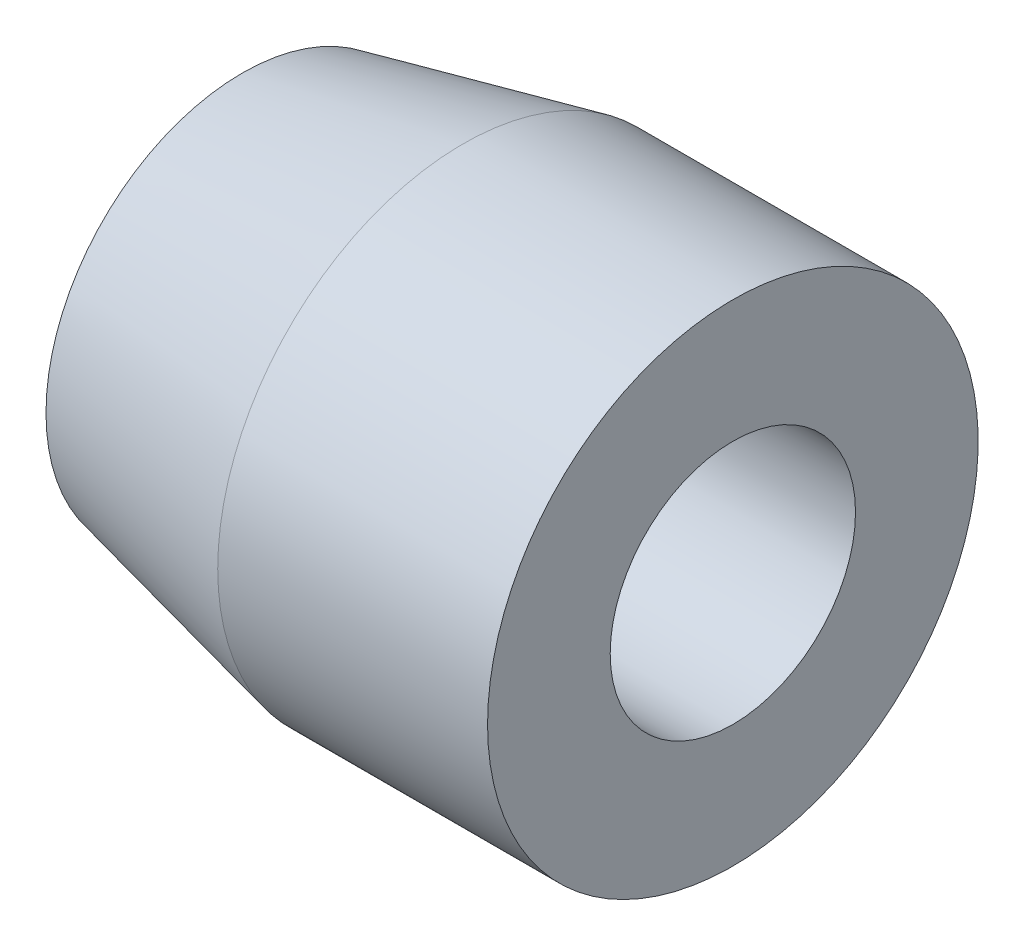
from build123d import *

# Parameters (mm, degrees)
ESQUISSE3_R             = 2.5
ENL_V_MAT_EXTRU_2_DEPTH = 7
ENL_V_MAT_EXTRU_4_DEPTH = 3


with BuildPart() as part:
    # Esquisse1 → Base-R_volution (revolve)
    with BuildSketch(Plane.XY, mode=Mode.PRIVATE) as base_r_volution_sk:
        Polygon((0, 0), (-5.5, 0), (-10, 1), (-10, 5), (0, 5), align=None)
    revolve(base_r_volution_sk.sketch.rotate(Axis((-40, 5, 0), (1, 0, 0)), 270), axis=Axis((-40, 5, 0), (1, 0, 0)))

    # Esquisse3 → Enl_v. mat.-Extru.2 (cut)
    with BuildSketch(Plane(origin=(0, 0, 0), x_dir=(0, 0, -1), z_dir=(1, 0, 0))):
        with Locations((0, 5)):
            Circle(ESQUISSE3_R)
    extrude(amount=-ENL_V_MAT_EXTRU_2_DEPTH, mode=Mode.SUBTRACT)

    # Esquisse4 → Enl_v. mat.-Extru.4 (cut)
    with BuildSketch(Plane.ZY.offset(10)):
        Polygon((-1.787522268, 7.941907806), (1.712477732, 7.941907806), (3.462477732, 4.910818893), (1.712477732, 1.879729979), (-1.787522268, 1.879729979), (-3.537522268, 4.910818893), align=None)
    extrude(amount=-ENL_V_MAT_EXTRU_4_DEPTH, mode=Mode.SUBTRACT)


solid = part.part
